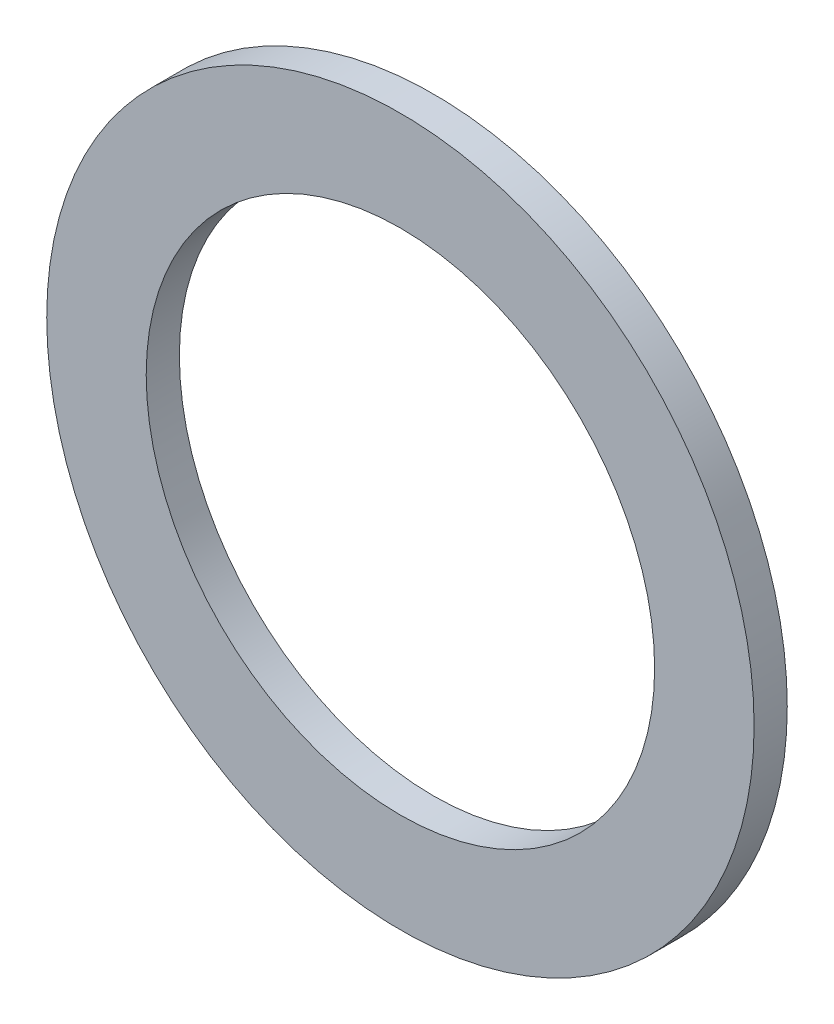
ISO-10303-21;
HEADER;
FILE_DESCRIPTION(('STEP AP214'),'2;1');
FILE_NAME('part.step','',(''),(''),'','','');
FILE_SCHEMA(('AUTOMOTIVE_DESIGN { 1 0 10303 214 1 1 1 1 }'));
ENDSEC;
DATA;
#1=APPLICATION_CONTEXT('core data for automotive mechanical design processes');
#2=APPLICATION_PROTOCOL_DEFINITION('international standard','automotive_design',2000,#1);
#3=PRODUCT_CONTEXT('',#1,'mechanical');
#4=PRODUCT('Part','Part','',(#3));
#5=PRODUCT_RELATED_PRODUCT_CATEGORY('part','',(#4));
#6=PRODUCT_DEFINITION_FORMATION('','',#4);
#7=PRODUCT_DEFINITION_CONTEXT('part definition',#1,'design');
#8=PRODUCT_DEFINITION('design','',#6,#7);
#9=PRODUCT_DEFINITION_SHAPE('','',#8);
#10=(LENGTH_UNIT() NAMED_UNIT(*) SI_UNIT(.MILLI.,.METRE.));
#11=(NAMED_UNIT(*) PLANE_ANGLE_UNIT() SI_UNIT($,.RADIAN.));
#12=(NAMED_UNIT(*) SI_UNIT($,.STERADIAN.) SOLID_ANGLE_UNIT());
#13=UNCERTAINTY_MEASURE_WITH_UNIT(LENGTH_MEASURE(1.E-05),#10,'distance_accuracy_value','');
#14=(GEOMETRIC_REPRESENTATION_CONTEXT(3) GLOBAL_UNCERTAINTY_ASSIGNED_CONTEXT((#13)) GLOBAL_UNIT_ASSIGNED_CONTEXT((#10,
#11,#12)) REPRESENTATION_CONTEXT('',''));
#15=CARTESIAN_POINT('',(0.,0.,0.));
#16=DIRECTION('',(0.,0.,1.));
#17=DIRECTION('',(1.,0.,0.));
#18=AXIS2_PLACEMENT_3D('',#15,#16,#17);
#19=CARTESIAN_POINT('',(0.,0.,3.));
#20=DIRECTION('',(0.,0.,1.));
#21=DIRECTION('',(1.,0.,0.));
#22=AXIS2_PLACEMENT_3D('',#19,#20,#21);
#23=PLANE('',#22);
#24=CARTESIAN_POINT('',(0.,0.,3.));
#25=DIRECTION('',(0.,0.,1.));
#26=DIRECTION('',(1.,0.,0.));
#27=AXIS2_PLACEMENT_3D('',#24,#25,#26);
#28=CIRCLE('',#27,32.);
#29=CARTESIAN_POINT('',(32.,0.,3.));
#30=VERTEX_POINT('',#29);
#31=EDGE_CURVE('E10',#30,#30,#28,.T.);
#32=ORIENTED_EDGE('',*,*,#31,.T.);
#33=EDGE_LOOP('',(#32));
#34=FACE_BOUND('',#33,.T.);
#35=CARTESIAN_POINT('',(0.,0.,3.));
#36=DIRECTION('',(0.,0.,1.));
#37=DIRECTION('',(1.,0.,0.));
#38=AXIS2_PLACEMENT_3D('',#35,#36,#37);
#39=CIRCLE('',#38,23.);
#40=CARTESIAN_POINT('',(23.,0.,3.));
#41=VERTEX_POINT('',#40);
#42=EDGE_CURVE('E357',#41,#41,#39,.T.);
#43=ORIENTED_EDGE('',*,*,#42,.F.);
#44=EDGE_LOOP('',(#43));
#45=FACE_BOUND('',#44,.T.);
#46=ADVANCED_FACE('F346',(#34,#45),#23,.T.);
#47=CARTESIAN_POINT('',(0.,0.,0.));
#48=DIRECTION('',(0.,0.,1.));
#49=DIRECTION('',(1.,0.,0.));
#50=AXIS2_PLACEMENT_3D('',#47,#48,#49);
#51=PLANE('',#50);
#52=CARTESIAN_POINT('',(0.,0.,0.));
#53=DIRECTION('',(0.,0.,1.));
#54=DIRECTION('',(1.,0.,0.));
#55=AXIS2_PLACEMENT_3D('',#52,#53,#54);
#56=CIRCLE('',#55,32.);
#57=CARTESIAN_POINT('',(32.,0.,0.));
#58=VERTEX_POINT('',#57);
#59=EDGE_CURVE('E353',#58,#58,#56,.T.);
#60=ORIENTED_EDGE('',*,*,#59,.F.);
#61=EDGE_LOOP('',(#60));
#62=FACE_BOUND('',#61,.T.);
#63=CARTESIAN_POINT('',(0.,0.,0.));
#64=DIRECTION('',(0.,0.,1.));
#65=DIRECTION('',(1.,0.,0.));
#66=AXIS2_PLACEMENT_3D('',#63,#64,#65);
#67=CIRCLE('',#66,23.);
#68=CARTESIAN_POINT('',(23.,0.,0.));
#69=VERTEX_POINT('',#68);
#70=EDGE_CURVE('E361',#69,#69,#67,.T.);
#71=ORIENTED_EDGE('',*,*,#70,.T.);
#72=EDGE_LOOP('',(#71));
#73=FACE_BOUND('',#72,.T.);
#74=ADVANCED_FACE('F367',(#62,#73),#51,.F.);
#75=CARTESIAN_POINT('',(0.,0.,3.));
#76=DIRECTION('',(0.,0.,-1.));
#77=DIRECTION('',(-1.,0.,0.));
#78=AXIS2_PLACEMENT_3D('',#75,#76,#77);
#79=CYLINDRICAL_SURFACE('',#78,32.);
#80=ORIENTED_EDGE('',*,*,#31,.F.);
#81=EDGE_LOOP('',(#80));
#82=FACE_BOUND('',#81,.T.);
#83=ORIENTED_EDGE('',*,*,#59,.T.);
#84=EDGE_LOOP('',(#83));
#85=FACE_BOUND('',#84,.T.);
#86=ADVANCED_FACE('F348',(#82,#85),#79,.T.);
#87=CARTESIAN_POINT('',(0.,0.,3.));
#88=DIRECTION('',(0.,0.,-1.));
#89=DIRECTION('',(-1.,0.,0.));
#90=AXIS2_PLACEMENT_3D('',#87,#88,#89);
#91=CYLINDRICAL_SURFACE('',#90,23.);
#92=ORIENTED_EDGE('',*,*,#42,.T.);
#93=EDGE_LOOP('',(#92));
#94=FACE_BOUND('',#93,.T.);
#95=ORIENTED_EDGE('',*,*,#70,.F.);
#96=EDGE_LOOP('',(#95));
#97=FACE_BOUND('',#96,.T.);
#98=ADVANCED_FACE('F369',(#94,#97),#91,.F.);
#99=CLOSED_SHELL('',(#46,#74,#86,#98));
#100=MANIFOLD_SOLID_BREP('B2',#99);
#101=ADVANCED_BREP_SHAPE_REPRESENTATION('',(#18,#100),#14);
#102=SHAPE_DEFINITION_REPRESENTATION(#9,#101);
ENDSEC;
END-ISO-10303-21;
